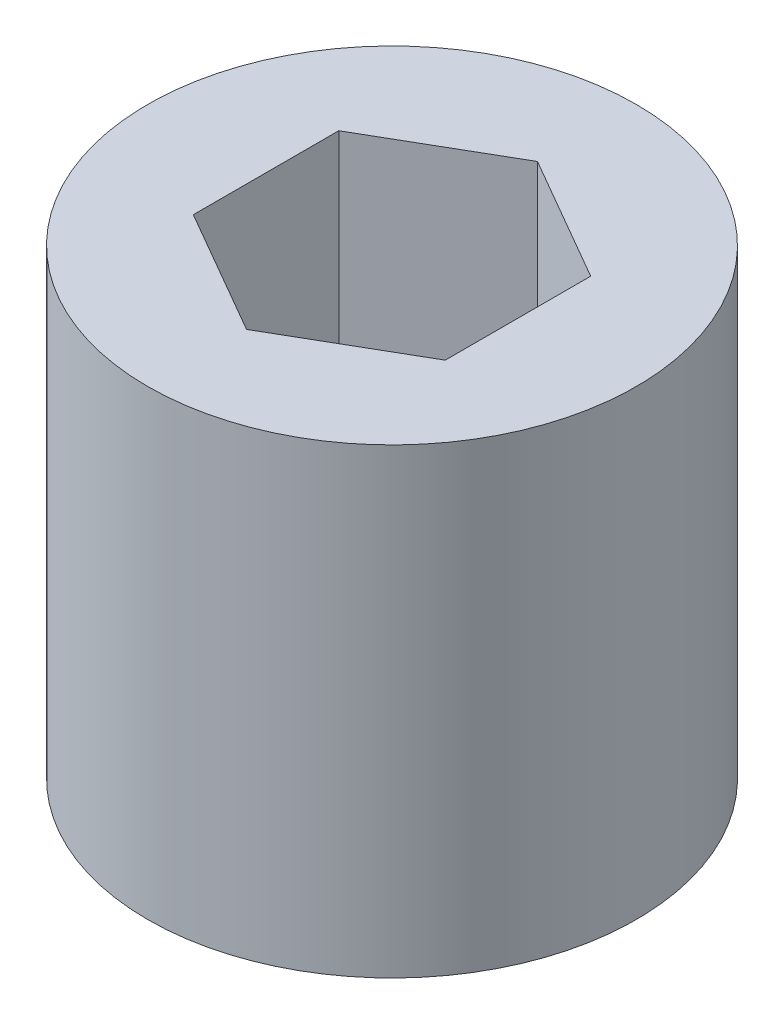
ISO-10303-21;
HEADER;
FILE_DESCRIPTION(('STEP AP214'),'2;1');
FILE_NAME('part.step','',(''),(''),'','','');
FILE_SCHEMA(('AUTOMOTIVE_DESIGN { 1 0 10303 214 1 1 1 1 }'));
ENDSEC;
DATA;
#1=APPLICATION_CONTEXT('core data for automotive mechanical design processes');
#2=APPLICATION_PROTOCOL_DEFINITION('international standard','automotive_design',2000,#1);
#3=PRODUCT_CONTEXT('',#1,'mechanical');
#4=PRODUCT('Part','Part','',(#3));
#5=PRODUCT_RELATED_PRODUCT_CATEGORY('part','',(#4));
#6=PRODUCT_DEFINITION_FORMATION('','',#4);
#7=PRODUCT_DEFINITION_CONTEXT('part definition',#1,'design');
#8=PRODUCT_DEFINITION('design','',#6,#7);
#9=PRODUCT_DEFINITION_SHAPE('','',#8);
#10=(LENGTH_UNIT() NAMED_UNIT(*) SI_UNIT(.MILLI.,.METRE.));
#11=(NAMED_UNIT(*) PLANE_ANGLE_UNIT() SI_UNIT($,.RADIAN.));
#12=(NAMED_UNIT(*) SI_UNIT($,.STERADIAN.) SOLID_ANGLE_UNIT());
#13=UNCERTAINTY_MEASURE_WITH_UNIT(LENGTH_MEASURE(1.E-05),#10,'distance_accuracy_value','');
#14=(GEOMETRIC_REPRESENTATION_CONTEXT(3) GLOBAL_UNCERTAINTY_ASSIGNED_CONTEXT((#13)) GLOBAL_UNIT_ASSIGNED_CONTEXT((#10,
#11,#12)) REPRESENTATION_CONTEXT('',''));
#15=CARTESIAN_POINT('',(0.,0.,0.));
#16=DIRECTION('',(0.,0.,1.));
#17=DIRECTION('',(1.,0.,0.));
#18=AXIS2_PLACEMENT_3D('',#15,#16,#17);
#19=CARTESIAN_POINT('',(0.,24.,0.));
#20=DIRECTION('',(0.,1.,0.));
#21=DIRECTION('',(0.,0.,1.));
#22=AXIS2_PLACEMENT_3D('',#19,#20,#21);
#23=PLANE('',#22);
#24=CARTESIAN_POINT('',(0.,24.,0.));
#25=DIRECTION('',(0.,1.,0.));
#26=DIRECTION('',(0.,0.,1.));
#27=AXIS2_PLACEMENT_3D('',#24,#25,#26);
#28=CIRCLE('',#27,12.7);
#29=CARTESIAN_POINT('',(0.,24.,12.7));
#30=VERTEX_POINT('',#29);
#31=EDGE_CURVE('E11',#30,#30,#28,.T.);
#32=ORIENTED_EDGE('',*,*,#31,.T.);
#33=EDGE_LOOP('',(#32));
#34=FACE_BOUND('',#33,.T.);
#35=DIRECTION('',(0.866025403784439,0.,0.5));
#36=VECTOR('',#35,1.);
#37=CARTESIAN_POINT('',(-6.5484375,24.,3.78074215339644));
#38=LINE('',#37,#36);
#39=CARTESIAN_POINT('',(-6.5484375,24.,3.78074215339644));
#40=VERTEX_POINT('',#39);
#41=CARTESIAN_POINT('',(0.,24.,7.56148430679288));
#42=VERTEX_POINT('',#41);
#43=EDGE_CURVE('E100',#40,#42,#38,.T.);
#44=ORIENTED_EDGE('',*,*,#43,.F.);
#45=DIRECTION('',(0.,0.,1.));
#46=VECTOR('',#45,1.);
#47=CARTESIAN_POINT('',(-6.5484375,24.,-3.78074215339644));
#48=LINE('',#47,#46);
#49=CARTESIAN_POINT('',(-6.5484375,24.,-3.78074215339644));
#50=VERTEX_POINT('',#49);
#51=EDGE_CURVE('E92',#50,#40,#48,.T.);
#52=ORIENTED_EDGE('',*,*,#51,.F.);
#53=DIRECTION('',(-0.866025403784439,0.,0.5));
#54=VECTOR('',#53,1.);
#55=CARTESIAN_POINT('',(0.,24.,-7.56148430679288));
#56=LINE('',#55,#54);
#57=CARTESIAN_POINT('',(0.,24.,-7.56148430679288));
#58=VERTEX_POINT('',#57);
#59=EDGE_CURVE('E120',#58,#50,#56,.T.);
#60=ORIENTED_EDGE('',*,*,#59,.F.);
#61=DIRECTION('',(-0.866025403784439,0.,-0.5));
#62=VECTOR('',#61,1.);
#63=CARTESIAN_POINT('',(6.5484375,24.,-3.78074215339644));
#64=LINE('',#63,#62);
#65=CARTESIAN_POINT('',(6.5484375,24.,-3.78074215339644));
#66=VERTEX_POINT('',#65);
#67=EDGE_CURVE('E118',#66,#58,#64,.T.);
#68=ORIENTED_EDGE('',*,*,#67,.F.);
#69=DIRECTION('',(0.,0.,-1.));
#70=VECTOR('',#69,1.);
#71=CARTESIAN_POINT('',(6.5484375,24.,3.78074215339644));
#72=LINE('',#71,#70);
#73=CARTESIAN_POINT('',(6.5484375,24.,3.78074215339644));
#74=VERTEX_POINT('',#73);
#75=EDGE_CURVE('E114',#74,#66,#72,.T.);
#76=ORIENTED_EDGE('',*,*,#75,.F.);
#77=DIRECTION('',(0.866025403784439,0.,-0.5));
#78=VECTOR('',#77,1.);
#79=CARTESIAN_POINT('',(0.,24.,7.56148430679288));
#80=LINE('',#79,#78);
#81=EDGE_CURVE('E112',#42,#74,#80,.T.);
#82=ORIENTED_EDGE('',*,*,#81,.F.);
#83=EDGE_LOOP('',(#44,#52,#60,#68,#76,#82));
#84=FACE_BOUND('',#83,.T.);
#85=ADVANCED_FACE('F39',(#34,#84),#23,.T.);
#86=CARTESIAN_POINT('',(0.,0.,0.));
#87=DIRECTION('',(0.,1.,0.));
#88=DIRECTION('',(0.,0.,1.));
#89=AXIS2_PLACEMENT_3D('',#86,#87,#88);
#90=PLANE('',#89);
#91=CARTESIAN_POINT('',(0.,0.,0.));
#92=DIRECTION('',(0.,1.,0.));
#93=DIRECTION('',(0.,0.,1.));
#94=AXIS2_PLACEMENT_3D('',#91,#92,#93);
#95=CIRCLE('',#94,12.7);
#96=CARTESIAN_POINT('',(0.,0.,12.7));
#97=VERTEX_POINT('',#96);
#98=EDGE_CURVE('E43',#97,#97,#95,.T.);
#99=ORIENTED_EDGE('',*,*,#98,.F.);
#100=EDGE_LOOP('',(#99));
#101=FACE_BOUND('',#100,.T.);
#102=DIRECTION('',(0.,0.,1.));
#103=VECTOR('',#102,1.);
#104=CARTESIAN_POINT('',(-6.5484375,0.,-3.78074215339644));
#105=LINE('',#104,#103);
#106=CARTESIAN_POINT('',(-6.5484375,0.,-3.78074215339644));
#107=VERTEX_POINT('',#106);
#108=CARTESIAN_POINT('',(-6.5484375,0.,3.78074215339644));
#109=VERTEX_POINT('',#108);
#110=EDGE_CURVE('E62',#107,#109,#105,.T.);
#111=ORIENTED_EDGE('',*,*,#110,.T.);
#112=DIRECTION('',(0.866025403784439,0.,0.5));
#113=VECTOR('',#112,1.);
#114=CARTESIAN_POINT('',(-6.5484375,0.,3.78074215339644));
#115=LINE('',#114,#113);
#116=CARTESIAN_POINT('',(0.,0.,7.56148430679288));
#117=VERTEX_POINT('',#116);
#118=EDGE_CURVE('E107',#109,#117,#115,.T.);
#119=ORIENTED_EDGE('',*,*,#118,.T.);
#120=DIRECTION('',(0.866025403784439,0.,-0.5));
#121=VECTOR('',#120,1.);
#122=CARTESIAN_POINT('',(0.,0.,7.56148430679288));
#123=LINE('',#122,#121);
#124=CARTESIAN_POINT('',(6.5484375,0.,3.78074215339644));
#125=VERTEX_POINT('',#124);
#126=EDGE_CURVE('E124',#117,#125,#123,.T.);
#127=ORIENTED_EDGE('',*,*,#126,.T.);
#128=DIRECTION('',(0.,0.,-1.));
#129=VECTOR('',#128,1.);
#130=CARTESIAN_POINT('',(6.5484375,0.,3.78074215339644));
#131=LINE('',#130,#129);
#132=CARTESIAN_POINT('',(6.5484375,0.,-3.78074215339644));
#133=VERTEX_POINT('',#132);
#134=EDGE_CURVE('E127',#125,#133,#131,.T.);
#135=ORIENTED_EDGE('',*,*,#134,.T.);
#136=DIRECTION('',(-0.866025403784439,0.,-0.5));
#137=VECTOR('',#136,1.);
#138=CARTESIAN_POINT('',(6.5484375,0.,-3.78074215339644));
#139=LINE('',#138,#137);
#140=CARTESIAN_POINT('',(0.,0.,-7.56148430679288));
#141=VERTEX_POINT('',#140);
#142=EDGE_CURVE('E130',#133,#141,#139,.T.);
#143=ORIENTED_EDGE('',*,*,#142,.T.);
#144=DIRECTION('',(-0.866025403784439,0.,0.5));
#145=VECTOR('',#144,1.);
#146=CARTESIAN_POINT('',(0.,0.,-7.56148430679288));
#147=LINE('',#146,#145);
#148=EDGE_CURVE('E101',#141,#107,#147,.T.);
#149=ORIENTED_EDGE('',*,*,#148,.T.);
#150=EDGE_LOOP('',(#111,#119,#127,#135,#143,#149));
#151=FACE_BOUND('',#150,.T.);
#152=ADVANCED_FACE('F147',(#101,#151),#90,.F.);
#153=CARTESIAN_POINT('',(0.,24.,0.));
#154=DIRECTION('',(0.,-1.,0.));
#155=DIRECTION('',(0.,0.,-1.));
#156=AXIS2_PLACEMENT_3D('',#153,#154,#155);
#157=CYLINDRICAL_SURFACE('',#156,12.7);
#158=ORIENTED_EDGE('',*,*,#31,.F.);
#159=EDGE_LOOP('',(#158));
#160=FACE_BOUND('',#159,.T.);
#161=ORIENTED_EDGE('',*,*,#98,.T.);
#162=EDGE_LOOP('',(#161));
#163=FACE_BOUND('',#162,.T.);
#164=ADVANCED_FACE('F41',(#160,#163),#157,.T.);
#165=CARTESIAN_POINT('',(-6.5484375,24.,-3.78074215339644));
#166=DIRECTION('',(1.,0.,0.));
#167=DIRECTION('',(0.,0.,-1.));
#168=AXIS2_PLACEMENT_3D('',#165,#166,#167);
#169=PLANE('',#168);
#170=ORIENTED_EDGE('',*,*,#110,.F.);
#171=DIRECTION('',(0.,-1.,0.));
#172=VECTOR('',#171,1.);
#173=CARTESIAN_POINT('',(-6.5484375,24.,-3.78074215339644));
#174=LINE('',#173,#172);
#175=EDGE_CURVE('E96',#50,#107,#174,.T.);
#176=ORIENTED_EDGE('',*,*,#175,.F.);
#177=ORIENTED_EDGE('',*,*,#51,.T.);
#178=DIRECTION('',(0.,-1.,0.));
#179=VECTOR('',#178,1.);
#180=CARTESIAN_POINT('',(-6.5484375,24.,3.78074215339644));
#181=LINE('',#180,#179);
#182=EDGE_CURVE('E95',#40,#109,#181,.T.);
#183=ORIENTED_EDGE('',*,*,#182,.T.);
#184=EDGE_LOOP('',(#170,#176,#177,#183));
#185=FACE_BOUND('',#184,.T.);
#186=ADVANCED_FACE('F94',(#185),#169,.T.);
#187=CARTESIAN_POINT('',(-6.5484375,24.,3.78074215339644));
#188=DIRECTION('',(0.5,0.,-0.866025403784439));
#189=DIRECTION('',(-0.866025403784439,0.,-0.5));
#190=AXIS2_PLACEMENT_3D('',#187,#188,#189);
#191=PLANE('',#190);
#192=ORIENTED_EDGE('',*,*,#118,.F.);
#193=ORIENTED_EDGE('',*,*,#182,.F.);
#194=ORIENTED_EDGE('',*,*,#43,.T.);
#195=DIRECTION('',(0.,-1.,0.));
#196=VECTOR('',#195,1.);
#197=CARTESIAN_POINT('',(0.,24.,7.56148430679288));
#198=LINE('',#197,#196);
#199=EDGE_CURVE('E108',#42,#117,#198,.T.);
#200=ORIENTED_EDGE('',*,*,#199,.T.);
#201=EDGE_LOOP('',(#192,#193,#194,#200));
#202=FACE_BOUND('',#201,.T.);
#203=ADVANCED_FACE('F104',(#202),#191,.T.);
#204=CARTESIAN_POINT('',(0.,24.,7.56148430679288));
#205=DIRECTION('',(-0.5,0.,-0.866025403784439));
#206=DIRECTION('',(-0.866025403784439,0.,0.5));
#207=AXIS2_PLACEMENT_3D('',#204,#205,#206);
#208=PLANE('',#207);
#209=ORIENTED_EDGE('',*,*,#126,.F.);
#210=ORIENTED_EDGE('',*,*,#199,.F.);
#211=ORIENTED_EDGE('',*,*,#81,.T.);
#212=DIRECTION('',(0.,-1.,0.));
#213=VECTOR('',#212,1.);
#214=CARTESIAN_POINT('',(6.5484375,24.,3.78074215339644));
#215=LINE('',#214,#213);
#216=EDGE_CURVE('E139',#74,#125,#215,.T.);
#217=ORIENTED_EDGE('',*,*,#216,.T.);
#218=EDGE_LOOP('',(#209,#210,#211,#217));
#219=FACE_BOUND('',#218,.T.);
#220=ADVANCED_FACE('F143',(#219),#208,.T.);
#221=CARTESIAN_POINT('',(6.5484375,24.,3.78074215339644));
#222=DIRECTION('',(-1.,0.,0.));
#223=DIRECTION('',(0.,0.,1.));
#224=AXIS2_PLACEMENT_3D('',#221,#222,#223);
#225=PLANE('',#224);
#226=ORIENTED_EDGE('',*,*,#134,.F.);
#227=ORIENTED_EDGE('',*,*,#216,.F.);
#228=ORIENTED_EDGE('',*,*,#75,.T.);
#229=DIRECTION('',(0.,-1.,0.));
#230=VECTOR('',#229,1.);
#231=CARTESIAN_POINT('',(6.5484375,24.,-3.78074215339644));
#232=LINE('',#231,#230);
#233=EDGE_CURVE('E137',#66,#133,#232,.T.);
#234=ORIENTED_EDGE('',*,*,#233,.T.);
#235=EDGE_LOOP('',(#226,#227,#228,#234));
#236=FACE_BOUND('',#235,.T.);
#237=ADVANCED_FACE('F155',(#236),#225,.T.);
#238=CARTESIAN_POINT('',(6.5484375,24.,-3.78074215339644));
#239=DIRECTION('',(-0.5,0.,0.866025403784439));
#240=DIRECTION('',(0.866025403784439,0.,0.5));
#241=AXIS2_PLACEMENT_3D('',#238,#239,#240);
#242=PLANE('',#241);
#243=ORIENTED_EDGE('',*,*,#142,.F.);
#244=ORIENTED_EDGE('',*,*,#233,.F.);
#245=ORIENTED_EDGE('',*,*,#67,.T.);
#246=DIRECTION('',(0.,-1.,0.));
#247=VECTOR('',#246,1.);
#248=CARTESIAN_POINT('',(0.,24.,-7.56148430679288));
#249=LINE('',#248,#247);
#250=EDGE_CURVE('E54',#58,#141,#249,.T.);
#251=ORIENTED_EDGE('',*,*,#250,.T.);
#252=EDGE_LOOP('',(#243,#244,#245,#251));
#253=FACE_BOUND('',#252,.T.);
#254=ADVANCED_FACE('F153',(#253),#242,.T.);
#255=CARTESIAN_POINT('',(0.,24.,-7.56148430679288));
#256=DIRECTION('',(0.5,0.,0.866025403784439));
#257=DIRECTION('',(0.866025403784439,0.,-0.5));
#258=AXIS2_PLACEMENT_3D('',#255,#256,#257);
#259=PLANE('',#258);
#260=ORIENTED_EDGE('',*,*,#148,.F.);
#261=ORIENTED_EDGE('',*,*,#250,.F.);
#262=ORIENTED_EDGE('',*,*,#59,.T.);
#263=ORIENTED_EDGE('',*,*,#175,.T.);
#264=EDGE_LOOP('',(#260,#261,#262,#263));
#265=FACE_BOUND('',#264,.T.);
#266=ADVANCED_FACE('F149',(#265),#259,.T.);
#267=CLOSED_SHELL('',(#85,#152,#164,#186,#203,#220,#237,#254,#266));
#268=MANIFOLD_SOLID_BREP('B2',#267);
#269=ADVANCED_BREP_SHAPE_REPRESENTATION('',(#18,#268),#14);
#270=SHAPE_DEFINITION_REPRESENTATION(#9,#269);
ENDSEC;
END-ISO-10303-21;
